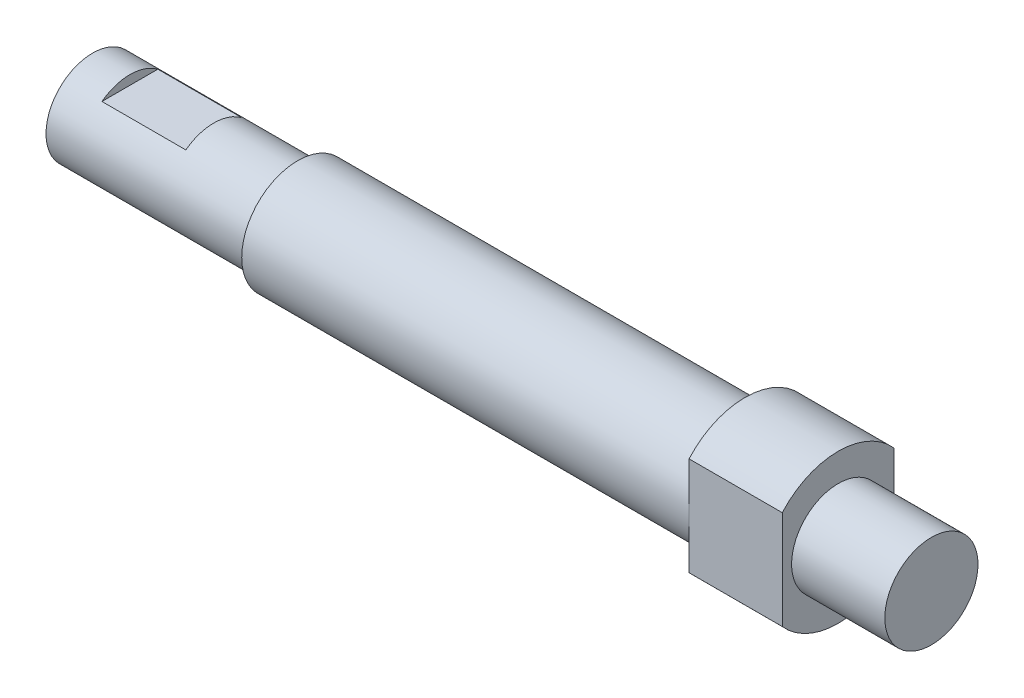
ISO-10303-21;
HEADER;
FILE_DESCRIPTION(('STEP AP214'),'2;1');
FILE_NAME('part.step','',(''),(''),'','','');
FILE_SCHEMA(('AUTOMOTIVE_DESIGN { 1 0 10303 214 1 1 1 1 }'));
ENDSEC;
DATA;
#1=APPLICATION_CONTEXT('core data for automotive mechanical design processes');
#2=APPLICATION_PROTOCOL_DEFINITION('international standard','automotive_design',2000,#1);
#3=PRODUCT_CONTEXT('',#1,'mechanical');
#4=PRODUCT('Part','Part','',(#3));
#5=PRODUCT_RELATED_PRODUCT_CATEGORY('part','',(#4));
#6=PRODUCT_DEFINITION_FORMATION('','',#4);
#7=PRODUCT_DEFINITION_CONTEXT('part definition',#1,'design');
#8=PRODUCT_DEFINITION('design','',#6,#7);
#9=PRODUCT_DEFINITION_SHAPE('','',#8);
#10=(LENGTH_UNIT() NAMED_UNIT(*) SI_UNIT(.MILLI.,.METRE.));
#11=(NAMED_UNIT(*) PLANE_ANGLE_UNIT() SI_UNIT($,.RADIAN.));
#12=(NAMED_UNIT(*) SI_UNIT($,.STERADIAN.) SOLID_ANGLE_UNIT());
#13=UNCERTAINTY_MEASURE_WITH_UNIT(LENGTH_MEASURE(1.E-05),#10,'distance_accuracy_value','');
#14=(GEOMETRIC_REPRESENTATION_CONTEXT(3) GLOBAL_UNCERTAINTY_ASSIGNED_CONTEXT((#13)) GLOBAL_UNIT_ASSIGNED_CONTEXT((#10,
#11,#12)) REPRESENTATION_CONTEXT('',''));
#15=CARTESIAN_POINT('',(0.,0.,0.));
#16=DIRECTION('',(0.,0.,1.));
#17=DIRECTION('',(1.,0.,0.));
#18=AXIS2_PLACEMENT_3D('',#15,#16,#17);
#19=CARTESIAN_POINT('',(-13.6442154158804,0.,0.));
#20=DIRECTION('',(-1.,0.,0.));
#21=DIRECTION('',(0.,0.,1.));
#22=AXIS2_PLACEMENT_3D('',#19,#20,#21);
#23=CYLINDRICAL_SURFACE('',#22,4.);
#24=DIRECTION('',(-1.,0.,0.));
#25=VECTOR('',#24,1.);
#26=CARTESIAN_POINT('',(-13.6442154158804,2.64575131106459,3.));
#27=LINE('',#26,#25);
#28=CARTESIAN_POINT('',(40.,2.64575131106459,3.));
#29=VERTEX_POINT('',#28);
#30=CARTESIAN_POINT('',(35.,2.64575131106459,3.));
#31=VERTEX_POINT('',#30);
#32=EDGE_CURVE('E56',#29,#31,#27,.T.);
#33=ORIENTED_EDGE('',*,*,#32,.F.);
#34=CARTESIAN_POINT('',(40.,0.,0.));
#35=DIRECTION('',(1.,0.,0.));
#36=DIRECTION('',(0.,0.,-1.));
#37=AXIS2_PLACEMENT_3D('',#34,#35,#36);
#38=CIRCLE('',#37,4.);
#39=CARTESIAN_POINT('',(40.,2.64575131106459,-3.));
#40=VERTEX_POINT('',#39);
#41=EDGE_CURVE('E147',#40,#29,#38,.T.);
#42=ORIENTED_EDGE('',*,*,#41,.F.);
#43=DIRECTION('',(-1.,0.,0.));
#44=VECTOR('',#43,1.);
#45=CARTESIAN_POINT('',(-13.6442154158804,2.64575131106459,-3.));
#46=LINE('',#45,#44);
#47=CARTESIAN_POINT('',(35.,2.64575131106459,-3.));
#48=VERTEX_POINT('',#47);
#49=EDGE_CURVE('E119',#48,#40,#46,.F.);
#50=ORIENTED_EDGE('',*,*,#49,.F.);
#51=CARTESIAN_POINT('',(35.,0.,0.));
#52=DIRECTION('',(-1.,0.,0.));
#53=DIRECTION('',(0.,0.,1.));
#54=AXIS2_PLACEMENT_3D('',#51,#52,#53);
#55=CIRCLE('',#54,4.);
#56=EDGE_CURVE('E136',#31,#48,#55,.T.);
#57=ORIENTED_EDGE('',*,*,#56,.F.);
#58=EDGE_LOOP('',(#33,#42,#50,#57));
#59=FACE_BOUND('',#58,.T.);
#60=ADVANCED_FACE('F33',(#59),#23,.T.);
#61=DIRECTION('',(-1.,0.,0.));
#62=VECTOR('',#61,1.);
#63=CARTESIAN_POINT('',(-13.6442154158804,-2.64575131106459,3.));
#64=LINE('',#63,#62);
#65=CARTESIAN_POINT('',(35.,-2.64575131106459,3.));
#66=VERTEX_POINT('',#65);
#67=CARTESIAN_POINT('',(40.,-2.64575131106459,3.));
#68=VERTEX_POINT('',#67);
#69=EDGE_CURVE('E113',#66,#68,#64,.F.);
#70=ORIENTED_EDGE('',*,*,#69,.F.);
#71=CARTESIAN_POINT('',(35.,-2.64575131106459,-3.));
#72=VERTEX_POINT('',#71);
#73=EDGE_CURVE('E137',#72,#66,#55,.T.);
#74=ORIENTED_EDGE('',*,*,#73,.F.);
#75=DIRECTION('',(-1.,0.,0.));
#76=VECTOR('',#75,1.);
#77=CARTESIAN_POINT('',(-13.6442154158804,-2.64575131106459,-3.));
#78=LINE('',#77,#76);
#79=CARTESIAN_POINT('',(40.,-2.64575131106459,-3.));
#80=VERTEX_POINT('',#79);
#81=EDGE_CURVE('E121',#80,#72,#78,.T.);
#82=ORIENTED_EDGE('',*,*,#81,.F.);
#83=EDGE_CURVE('E144',#68,#80,#38,.T.);
#84=ORIENTED_EDGE('',*,*,#83,.F.);
#85=EDGE_LOOP('',(#70,#74,#82,#84));
#86=FACE_BOUND('',#85,.T.);
#87=ADVANCED_FACE('F178',(#86),#23,.T.);
#88=CARTESIAN_POINT('',(40.,0.,0.));
#89=DIRECTION('',(1.,0.,0.));
#90=DIRECTION('',(0.,0.,-1.));
#91=AXIS2_PLACEMENT_3D('',#88,#89,#90);
#92=PLANE('',#91);
#93=CARTESIAN_POINT('',(40.,0.,0.));
#94=DIRECTION('',(1.,0.,0.));
#95=DIRECTION('',(0.,0.,-1.));
#96=AXIS2_PLACEMENT_3D('',#93,#94,#95);
#97=CIRCLE('',#96,2.5);
#98=CARTESIAN_POINT('',(40.,0.,-2.5));
#99=VERTEX_POINT('',#98);
#100=EDGE_CURVE('E141',#99,#99,#97,.T.);
#101=ORIENTED_EDGE('',*,*,#100,.F.);
#102=EDGE_LOOP('',(#101));
#103=FACE_BOUND('',#102,.T.);
#104=ORIENTED_EDGE('',*,*,#41,.T.);
#105=DIRECTION('',(0.,-1.,0.));
#106=VECTOR('',#105,1.);
#107=CARTESIAN_POINT('',(40.,-4.,3.));
#108=LINE('',#107,#106);
#109=EDGE_CURVE('E105',#29,#68,#108,.T.);
#110=ORIENTED_EDGE('',*,*,#109,.T.);
#111=ORIENTED_EDGE('',*,*,#83,.T.);
#112=DIRECTION('',(0.,1.,0.));
#113=VECTOR('',#112,1.);
#114=CARTESIAN_POINT('',(40.,4.,-3.));
#115=LINE('',#114,#113);
#116=EDGE_CURVE('E116',#80,#40,#115,.T.);
#117=ORIENTED_EDGE('',*,*,#116,.T.);
#118=EDGE_LOOP('',(#104,#110,#111,#117));
#119=FACE_BOUND('',#118,.T.);
#120=ADVANCED_FACE('F181',(#103,#119),#92,.T.);
#121=CARTESIAN_POINT('',(35.,0.,0.));
#122=DIRECTION('',(-1.,0.,0.));
#123=DIRECTION('',(0.,0.,1.));
#124=AXIS2_PLACEMENT_3D('',#121,#122,#123);
#125=PLANE('',#124);
#126=ORIENTED_EDGE('',*,*,#73,.T.);
#127=DIRECTION('',(0.,1.,0.));
#128=VECTOR('',#127,1.);
#129=CARTESIAN_POINT('',(35.,-4.,3.));
#130=LINE('',#129,#128);
#131=CARTESIAN_POINT('',(35.,0.,3.));
#132=VERTEX_POINT('',#131);
#133=EDGE_CURVE('E112',#66,#132,#130,.T.);
#134=ORIENTED_EDGE('',*,*,#133,.T.);
#135=CARTESIAN_POINT('',(35.,0.,0.));
#136=DIRECTION('',(-1.,0.,0.));
#137=DIRECTION('',(0.,0.,1.));
#138=AXIS2_PLACEMENT_3D('',#135,#136,#137);
#139=CIRCLE('',#138,3.);
#140=CARTESIAN_POINT('',(35.,0.,-3.));
#141=VERTEX_POINT('',#140);
#142=EDGE_CURVE('E133',#141,#132,#139,.T.);
#143=ORIENTED_EDGE('',*,*,#142,.F.);
#144=DIRECTION('',(0.,-1.,0.));
#145=VECTOR('',#144,1.);
#146=CARTESIAN_POINT('',(35.,0.,-3.));
#147=LINE('',#146,#145);
#148=EDGE_CURVE('E150',#141,#72,#147,.T.);
#149=ORIENTED_EDGE('',*,*,#148,.T.);
#150=EDGE_LOOP('',(#126,#134,#143,#149));
#151=FACE_BOUND('',#150,.T.);
#152=ADVANCED_FACE('F167',(#151),#125,.T.);
#153=EDGE_CURVE('E132',#132,#141,#139,.T.);
#154=ORIENTED_EDGE('',*,*,#153,.F.);
#155=EDGE_CURVE('E110',#132,#31,#130,.T.);
#156=ORIENTED_EDGE('',*,*,#155,.T.);
#157=ORIENTED_EDGE('',*,*,#56,.T.);
#158=EDGE_CURVE('E153',#48,#141,#147,.T.);
#159=ORIENTED_EDGE('',*,*,#158,.T.);
#160=EDGE_LOOP('',(#154,#156,#157,#159));
#161=FACE_BOUND('',#160,.T.);
#162=ADVANCED_FACE('F160',(#161),#125,.T.);
#163=CARTESIAN_POINT('',(35.,0.,0.));
#164=DIRECTION('',(-1.,0.,0.));
#165=DIRECTION('',(0.,0.,1.));
#166=AXIS2_PLACEMENT_3D('',#163,#164,#165);
#167=CYLINDRICAL_SURFACE('',#166,3.);
#168=ORIENTED_EDGE('',*,*,#142,.T.);
#169=ORIENTED_EDGE('',*,*,#153,.T.);
#170=EDGE_LOOP('',(#168,#169));
#171=FACE_BOUND('',#170,.T.);
#172=CARTESIAN_POINT('',(11.,0.,0.));
#173=DIRECTION('',(-1.,0.,0.));
#174=DIRECTION('',(0.,0.,1.));
#175=AXIS2_PLACEMENT_3D('',#172,#173,#174);
#176=CIRCLE('',#175,3.);
#177=CARTESIAN_POINT('',(11.,0.,3.));
#178=VERTEX_POINT('',#177);
#179=EDGE_CURVE('E127',#178,#178,#176,.T.);
#180=ORIENTED_EDGE('',*,*,#179,.F.);
#181=EDGE_LOOP('',(#180));
#182=FACE_BOUND('',#181,.T.);
#183=ADVANCED_FACE('F170',(#171,#182),#167,.T.);
#184=CARTESIAN_POINT('',(40.,0.,0.));
#185=DIRECTION('',(1.,0.,0.));
#186=DIRECTION('',(0.,0.,-1.));
#187=AXIS2_PLACEMENT_3D('',#184,#185,#186);
#188=CYLINDRICAL_SURFACE('',#187,2.5);
#189=ORIENTED_EDGE('',*,*,#100,.T.);
#190=EDGE_LOOP('',(#189));
#191=FACE_BOUND('',#190,.T.);
#192=CARTESIAN_POINT('',(45.,0.,0.));
#193=DIRECTION('',(1.,0.,0.));
#194=DIRECTION('',(0.,0.,-1.));
#195=AXIS2_PLACEMENT_3D('',#192,#193,#194);
#196=CIRCLE('',#195,2.5);
#197=CARTESIAN_POINT('',(45.,0.,-2.5));
#198=VERTEX_POINT('',#197);
#199=EDGE_CURVE('E140',#198,#198,#196,.T.);
#200=ORIENTED_EDGE('',*,*,#199,.F.);
#201=EDGE_LOOP('',(#200));
#202=FACE_BOUND('',#201,.T.);
#203=ADVANCED_FACE('F193',(#191,#202),#188,.T.);
#204=CARTESIAN_POINT('',(45.,0.,0.));
#205=DIRECTION('',(-1.,0.,0.));
#206=DIRECTION('',(0.,0.,1.));
#207=AXIS2_PLACEMENT_3D('',#204,#205,#206);
#208=PLANE('',#207);
#209=ORIENTED_EDGE('',*,*,#199,.T.);
#210=EDGE_LOOP('',(#209));
#211=FACE_BOUND('',#210,.T.);
#212=ADVANCED_FACE('F189',(#211),#208,.F.);
#213=CARTESIAN_POINT('',(11.,0.,0.));
#214=DIRECTION('',(-1.,0.,0.));
#215=DIRECTION('',(0.,0.,1.));
#216=AXIS2_PLACEMENT_3D('',#213,#214,#215);
#217=PLANE('',#216);
#218=CARTESIAN_POINT('',(11.,0.,0.));
#219=DIRECTION('',(-1.,0.,0.));
#220=DIRECTION('',(0.,0.,1.));
#221=AXIS2_PLACEMENT_3D('',#218,#219,#220);
#222=CIRCLE('',#221,2.5);
#223=CARTESIAN_POINT('',(11.,0.,2.5));
#224=VERTEX_POINT('',#223);
#225=EDGE_CURVE('E124',#224,#224,#222,.T.);
#226=ORIENTED_EDGE('',*,*,#225,.F.);
#227=EDGE_LOOP('',(#226));
#228=FACE_BOUND('',#227,.T.);
#229=ORIENTED_EDGE('',*,*,#179,.T.);
#230=EDGE_LOOP('',(#229));
#231=FACE_BOUND('',#230,.T.);
#232=ADVANCED_FACE('F192',(#228,#231),#217,.T.);
#233=CARTESIAN_POINT('',(11.,0.,0.));
#234=DIRECTION('',(-1.,0.,0.));
#235=DIRECTION('',(0.,0.,1.));
#236=AXIS2_PLACEMENT_3D('',#233,#234,#235);
#237=CYLINDRICAL_SURFACE('',#236,2.5);
#238=CARTESIAN_POINT('',(2.,0.,0.));
#239=DIRECTION('',(-1.,0.,0.));
#240=DIRECTION('',(0.,0.,1.));
#241=AXIS2_PLACEMENT_3D('',#238,#239,#240);
#242=CIRCLE('',#241,2.5);
#243=CARTESIAN_POINT('',(2.,2.,-1.5));
#244=VERTEX_POINT('',#243);
#245=CARTESIAN_POINT('',(2.,2.,1.5));
#246=VERTEX_POINT('',#245);
#247=EDGE_CURVE('E93',#244,#246,#242,.F.);
#248=ORIENTED_EDGE('',*,*,#247,.F.);
#249=DIRECTION('',(-1.,0.,0.));
#250=VECTOR('',#249,1.);
#251=CARTESIAN_POINT('',(11.,2.,-1.5));
#252=LINE('',#251,#250);
#253=CARTESIAN_POINT('',(6.5,2.,-1.5));
#254=VERTEX_POINT('',#253);
#255=EDGE_CURVE('E11',#244,#254,#252,.F.);
#256=ORIENTED_EDGE('',*,*,#255,.T.);
#257=CARTESIAN_POINT('',(6.5,0.,0.));
#258=DIRECTION('',(1.,0.,0.));
#259=DIRECTION('',(0.,0.,-1.));
#260=AXIS2_PLACEMENT_3D('',#257,#258,#259);
#261=CIRCLE('',#260,2.5);
#262=CARTESIAN_POINT('',(6.5,2.,1.5));
#263=VERTEX_POINT('',#262);
#264=EDGE_CURVE('E97',#263,#254,#261,.F.);
#265=ORIENTED_EDGE('',*,*,#264,.F.);
#266=DIRECTION('',(-1.,0.,0.));
#267=VECTOR('',#266,1.);
#268=CARTESIAN_POINT('',(11.,2.,1.5));
#269=LINE('',#268,#267);
#270=EDGE_CURVE('E41',#263,#246,#269,.T.);
#271=ORIENTED_EDGE('',*,*,#270,.T.);
#272=EDGE_LOOP('',(#248,#256,#265,#271));
#273=FACE_BOUND('',#272,.T.);
#274=ORIENTED_EDGE('',*,*,#225,.T.);
#275=EDGE_LOOP('',(#274));
#276=FACE_BOUND('',#275,.T.);
#277=CARTESIAN_POINT('',(0.,0.,0.));
#278=DIRECTION('',(-1.,0.,0.));
#279=DIRECTION('',(0.,0.,1.));
#280=AXIS2_PLACEMENT_3D('',#277,#278,#279);
#281=CIRCLE('',#280,2.5);
#282=CARTESIAN_POINT('',(0.,0.,2.5));
#283=VERTEX_POINT('',#282);
#284=EDGE_CURVE('E123',#283,#283,#281,.T.);
#285=ORIENTED_EDGE('',*,*,#284,.F.);
#286=EDGE_LOOP('',(#285));
#287=FACE_BOUND('',#286,.T.);
#288=ADVANCED_FACE('F94',(#273,#276,#287),#237,.T.);
#289=CARTESIAN_POINT('',(0.,0.,0.));
#290=DIRECTION('',(1.,0.,0.));
#291=DIRECTION('',(0.,0.,-1.));
#292=AXIS2_PLACEMENT_3D('',#289,#290,#291);
#293=PLANE('',#292);
#294=ORIENTED_EDGE('',*,*,#284,.T.);
#295=EDGE_LOOP('',(#294));
#296=FACE_BOUND('',#295,.T.);
#297=ADVANCED_FACE('F35',(#296),#293,.F.);
#298=CARTESIAN_POINT('',(0.,0.,-3.));
#299=DIRECTION('',(0.,0.,-1.));
#300=DIRECTION('',(-1.,0.,0.));
#301=AXIS2_PLACEMENT_3D('',#298,#299,#300);
#302=PLANE('',#301);
#303=ORIENTED_EDGE('',*,*,#81,.T.);
#304=ORIENTED_EDGE('',*,*,#148,.F.);
#305=ORIENTED_EDGE('',*,*,#158,.F.);
#306=ORIENTED_EDGE('',*,*,#49,.T.);
#307=ORIENTED_EDGE('',*,*,#116,.F.);
#308=EDGE_LOOP('',(#303,#304,#305,#306,#307));
#309=FACE_BOUND('',#308,.T.);
#310=ADVANCED_FACE('F172',(#309),#302,.T.);
#311=CARTESIAN_POINT('',(0.,0.,3.));
#312=DIRECTION('',(0.,0.,1.));
#313=DIRECTION('',(-1.,0.,0.));
#314=AXIS2_PLACEMENT_3D('',#311,#312,#313);
#315=PLANE('',#314);
#316=ORIENTED_EDGE('',*,*,#32,.T.);
#317=ORIENTED_EDGE('',*,*,#155,.F.);
#318=ORIENTED_EDGE('',*,*,#133,.F.);
#319=ORIENTED_EDGE('',*,*,#69,.T.);
#320=ORIENTED_EDGE('',*,*,#109,.F.);
#321=EDGE_LOOP('',(#316,#317,#318,#319,#320));
#322=FACE_BOUND('',#321,.T.);
#323=ADVANCED_FACE('F179',(#322),#315,.T.);
#324=CARTESIAN_POINT('',(2.,2.,-2.5));
#325=DIRECTION('',(-1.,0.,0.));
#326=DIRECTION('',(0.,0.,1.));
#327=AXIS2_PLACEMENT_3D('',#324,#325,#326);
#328=PLANE('',#327);
#329=DIRECTION('',(0.,0.,1.));
#330=VECTOR('',#329,1.);
#331=CARTESIAN_POINT('',(2.,2.,-2.5));
#332=LINE('',#331,#330);
#333=EDGE_CURVE('E48',#244,#246,#332,.T.);
#334=ORIENTED_EDGE('',*,*,#333,.F.);
#335=ORIENTED_EDGE('',*,*,#247,.T.);
#336=EDGE_LOOP('',(#334,#335));
#337=FACE_BOUND('',#336,.T.);
#338=ADVANCED_FACE('F103',(#337),#328,.F.);
#339=CARTESIAN_POINT('',(6.5,2.,-2.5));
#340=DIRECTION('',(1.,0.,0.));
#341=DIRECTION('',(0.,0.,-1.));
#342=AXIS2_PLACEMENT_3D('',#339,#340,#341);
#343=PLANE('',#342);
#344=DIRECTION('',(0.,0.,-1.));
#345=VECTOR('',#344,1.);
#346=CARTESIAN_POINT('',(6.5,2.,-2.5));
#347=LINE('',#346,#345);
#348=EDGE_CURVE('E102',#263,#254,#347,.T.);
#349=ORIENTED_EDGE('',*,*,#348,.F.);
#350=ORIENTED_EDGE('',*,*,#264,.T.);
#351=EDGE_LOOP('',(#349,#350));
#352=FACE_BOUND('',#351,.T.);
#353=ADVANCED_FACE('F216',(#352),#343,.F.);
#354=CARTESIAN_POINT('',(0.,2.,0.));
#355=DIRECTION('',(0.,1.,0.));
#356=DIRECTION('',(0.,0.,1.));
#357=AXIS2_PLACEMENT_3D('',#354,#355,#356);
#358=PLANE('',#357);
#359=ORIENTED_EDGE('',*,*,#333,.T.);
#360=ORIENTED_EDGE('',*,*,#270,.F.);
#361=ORIENTED_EDGE('',*,*,#348,.T.);
#362=ORIENTED_EDGE('',*,*,#255,.F.);
#363=EDGE_LOOP('',(#359,#360,#361,#362));
#364=FACE_BOUND('',#363,.T.);
#365=ADVANCED_FACE('F100',(#364),#358,.T.);
#366=CLOSED_SHELL('',(#60,#87,#120,#152,#162,#183,#203,#212,#232,#288,#297,#310,#323,#338,#353,#365));
#367=MANIFOLD_SOLID_BREP('B2',#366);
#368=ADVANCED_BREP_SHAPE_REPRESENTATION('',(#18,#367),#14);
#369=SHAPE_DEFINITION_REPRESENTATION(#9,#368);
ENDSEC;
END-ISO-10303-21;
